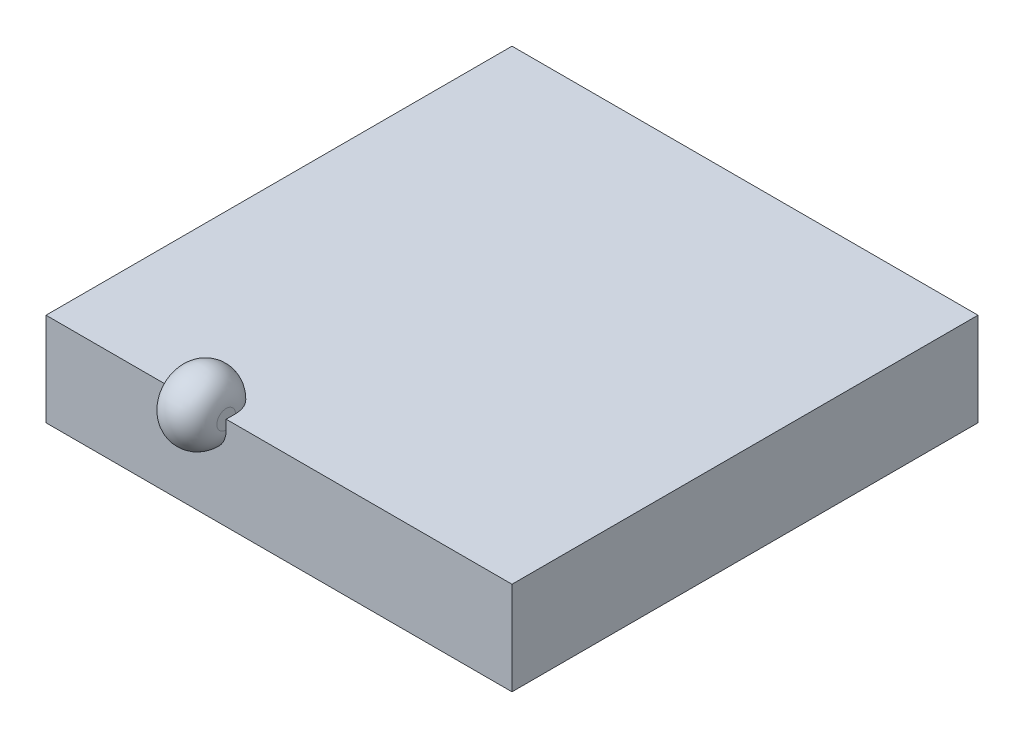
ISO-10303-21;
HEADER;
FILE_DESCRIPTION(('STEP AP214'),'2;1');
FILE_NAME('part.step','',(''),(''),'','','');
FILE_SCHEMA(('AUTOMOTIVE_DESIGN { 1 0 10303 214 1 1 1 1 }'));
ENDSEC;
DATA;
#1=APPLICATION_CONTEXT('core data for automotive mechanical design processes');
#2=APPLICATION_PROTOCOL_DEFINITION('international standard','automotive_design',2000,#1);
#3=PRODUCT_CONTEXT('',#1,'mechanical');
#4=PRODUCT('Part','Part','',(#3));
#5=PRODUCT_RELATED_PRODUCT_CATEGORY('part','',(#4));
#6=PRODUCT_DEFINITION_FORMATION('','',#4);
#7=PRODUCT_DEFINITION_CONTEXT('part definition',#1,'design');
#8=PRODUCT_DEFINITION('design','',#6,#7);
#9=PRODUCT_DEFINITION_SHAPE('','',#8);
#10=(LENGTH_UNIT() NAMED_UNIT(*) SI_UNIT(.MILLI.,.METRE.));
#11=(NAMED_UNIT(*) PLANE_ANGLE_UNIT() SI_UNIT($,.RADIAN.));
#12=(NAMED_UNIT(*) SI_UNIT($,.STERADIAN.) SOLID_ANGLE_UNIT());
#13=UNCERTAINTY_MEASURE_WITH_UNIT(LENGTH_MEASURE(1.E-05),#10,'distance_accuracy_value','');
#14=(GEOMETRIC_REPRESENTATION_CONTEXT(3) GLOBAL_UNCERTAINTY_ASSIGNED_CONTEXT((#13)) GLOBAL_UNIT_ASSIGNED_CONTEXT((#10,
#11,#12)) REPRESENTATION_CONTEXT('',''));
#15=CARTESIAN_POINT('',(0.,0.,0.));
#16=DIRECTION('',(0.,0.,1.));
#17=DIRECTION('',(1.,0.,0.));
#18=AXIS2_PLACEMENT_3D('',#15,#16,#17);
#19=CARTESIAN_POINT('',(-17.,27.,75.));
#20=DIRECTION('',(1.,0.,0.));
#21=DIRECTION('',(0.,1.,0.));
#22=AXIS2_PLACEMENT_3D('',#19,#20,#21);
#23=PLANE('',#22);
#24=CARTESIAN_POINT('',(-17.,30.,75.));
#25=DIRECTION('',(-1.,0.,0.));
#26=DIRECTION('',(0.,-1.,0.));
#27=AXIS2_PLACEMENT_3D('',#24,#25,#26);
#28=CIRCLE('',#27,3.);
#29=CARTESIAN_POINT('',(-17.,27.,75.));
#30=VERTEX_POINT('',#29);
#31=EDGE_CURVE('E47',#30,#30,#28,.T.);
#32=ORIENTED_EDGE('',*,*,#31,.F.);
#33=EDGE_LOOP('',(#32));
#34=FACE_BOUND('',#33,.T.);
#35=ADVANCED_FACE('F41',(#34),#23,.T.);
#36=CARTESIAN_POINT('',(-33.,30.,75.));
#37=DIRECTION('',(-1.,0.,0.));
#38=DIRECTION('',(0.,-1.,0.));
#39=AXIS2_PLACEMENT_3D('',#36,#37,#38);
#40=PLANE('',#39);
#41=CARTESIAN_POINT('',(-33.,30.,75.));
#42=DIRECTION('',(-1.,0.,0.));
#43=DIRECTION('',(0.,-1.,0.));
#44=AXIS2_PLACEMENT_3D('',#41,#42,#43);
#45=CIRCLE('',#44,3.);
#46=CARTESIAN_POINT('',(-33.,27.,75.));
#47=VERTEX_POINT('',#46);
#48=EDGE_CURVE('E11',#47,#47,#45,.T.);
#49=ORIENTED_EDGE('',*,*,#48,.T.);
#50=EDGE_LOOP('',(#49));
#51=FACE_BOUND('',#50,.T.);
#52=ADVANCED_FACE('F57',(#51),#40,.T.);
#53=CARTESIAN_POINT('',(-25.,30.,75.));
#54=DIRECTION('',(-1.,0.,0.));
#55=DIRECTION('',(0.,-1.,0.));
#56=AXIS2_PLACEMENT_3D('',#53,#54,#55);
#57=DEGENERATE_TOROIDAL_SURFACE('',#56,3.,8.00000000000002,.T.);
#58=ORIENTED_EDGE('',*,*,#31,.T.);
#59=EDGE_LOOP('',(#58));
#60=FACE_BOUND('',#59,.T.);
#61=ORIENTED_EDGE('',*,*,#48,.F.);
#62=EDGE_LOOP('',(#61));
#63=FACE_BOUND('',#62,.T.);
#64=ADVANCED_FACE('F53',(#60,#63),#57,.T.);
#65=CLOSED_SHELL('',(#35,#52,#64));
#66=MANIFOLD_SOLID_BREP('B2',#65);
#67=CARTESIAN_POINT('',(75.,30.,75.));
#68=DIRECTION('',(-1.,0.,0.));
#69=DIRECTION('',(0.,0.,1.));
#70=AXIS2_PLACEMENT_3D('',#67,#68,#69);
#71=PLANE('',#70);
#72=DIRECTION('',(0.,0.,-1.));
#73=VECTOR('',#72,1.);
#74=CARTESIAN_POINT('',(75.,0.,75.));
#75=LINE('',#74,#73);
#76=CARTESIAN_POINT('',(75.,0.,75.));
#77=VERTEX_POINT('',#76);
#78=CARTESIAN_POINT('',(75.,0.,-75.));
#79=VERTEX_POINT('',#78);
#80=EDGE_CURVE('E145',#77,#79,#75,.T.);
#81=ORIENTED_EDGE('',*,*,#80,.T.);
#82=DIRECTION('',(0.,-1.,0.));
#83=VECTOR('',#82,1.);
#84=CARTESIAN_POINT('',(75.,30.,-75.));
#85=LINE('',#84,#83);
#86=CARTESIAN_POINT('',(75.,30.,-75.));
#87=VERTEX_POINT('',#86);
#88=EDGE_CURVE('E39',#87,#79,#85,.T.);
#89=ORIENTED_EDGE('',*,*,#88,.F.);
#90=DIRECTION('',(0.,0.,-1.));
#91=VECTOR('',#90,1.);
#92=CARTESIAN_POINT('',(75.,30.,75.));
#93=LINE('',#92,#91);
#94=CARTESIAN_POINT('',(75.,30.,75.));
#95=VERTEX_POINT('',#94);
#96=EDGE_CURVE('E133',#95,#87,#93,.T.);
#97=ORIENTED_EDGE('',*,*,#96,.F.);
#98=DIRECTION('',(0.,-1.,0.));
#99=VECTOR('',#98,1.);
#100=CARTESIAN_POINT('',(75.,30.,75.));
#101=LINE('',#100,#99);
#102=EDGE_CURVE('E141',#95,#77,#101,.T.);
#103=ORIENTED_EDGE('',*,*,#102,.T.);
#104=EDGE_LOOP('',(#81,#89,#97,#103));
#105=FACE_BOUND('',#104,.T.);
#106=ADVANCED_FACE('F82',(#105),#71,.F.);
#107=CARTESIAN_POINT('',(-75.,30.,-75.));
#108=DIRECTION('',(0.,0.,1.));
#109=DIRECTION('',(1.,0.,0.));
#110=AXIS2_PLACEMENT_3D('',#107,#108,#109);
#111=PLANE('',#110);
#112=DIRECTION('',(-1.,0.,0.));
#113=VECTOR('',#112,1.);
#114=CARTESIAN_POINT('',(-75.,0.,-75.));
#115=LINE('',#114,#113);
#116=CARTESIAN_POINT('',(-75.,0.,-75.));
#117=VERTEX_POINT('',#116);
#118=EDGE_CURVE('E137',#79,#117,#115,.T.);
#119=ORIENTED_EDGE('',*,*,#118,.T.);
#120=DIRECTION('',(0.,-1.,0.));
#121=VECTOR('',#120,1.);
#122=CARTESIAN_POINT('',(-75.,30.,-75.));
#123=LINE('',#122,#121);
#124=CARTESIAN_POINT('',(-75.,30.,-75.));
#125=VERTEX_POINT('',#124);
#126=EDGE_CURVE('E90',#125,#117,#123,.T.);
#127=ORIENTED_EDGE('',*,*,#126,.F.);
#128=DIRECTION('',(-1.,0.,0.));
#129=VECTOR('',#128,1.);
#130=CARTESIAN_POINT('',(-75.,30.,-75.));
#131=LINE('',#130,#129);
#132=EDGE_CURVE('E128',#87,#125,#131,.T.);
#133=ORIENTED_EDGE('',*,*,#132,.F.);
#134=ORIENTED_EDGE('',*,*,#88,.T.);
#135=EDGE_LOOP('',(#119,#127,#133,#134));
#136=FACE_BOUND('',#135,.T.);
#137=ADVANCED_FACE('F136',(#136),#111,.F.);
#138=CARTESIAN_POINT('',(-75.,30.,75.));
#139=DIRECTION('',(1.,0.,0.));
#140=DIRECTION('',(0.,0.,-1.));
#141=AXIS2_PLACEMENT_3D('',#138,#139,#140);
#142=PLANE('',#141);
#143=DIRECTION('',(0.,0.,1.));
#144=VECTOR('',#143,1.);
#145=CARTESIAN_POINT('',(-75.,0.,75.));
#146=LINE('',#145,#144);
#147=CARTESIAN_POINT('',(-75.,0.,75.));
#148=VERTEX_POINT('',#147);
#149=EDGE_CURVE('E115',#117,#148,#146,.T.);
#150=ORIENTED_EDGE('',*,*,#149,.T.);
#151=DIRECTION('',(0.,-1.,0.));
#152=VECTOR('',#151,1.);
#153=CARTESIAN_POINT('',(-75.,30.,75.));
#154=LINE('',#153,#152);
#155=CARTESIAN_POINT('',(-75.,30.,75.));
#156=VERTEX_POINT('',#155);
#157=EDGE_CURVE('E138',#156,#148,#154,.T.);
#158=ORIENTED_EDGE('',*,*,#157,.F.);
#159=DIRECTION('',(0.,0.,1.));
#160=VECTOR('',#159,1.);
#161=CARTESIAN_POINT('',(-75.,30.,75.));
#162=LINE('',#161,#160);
#163=EDGE_CURVE('E131',#125,#156,#162,.T.);
#164=ORIENTED_EDGE('',*,*,#163,.F.);
#165=ORIENTED_EDGE('',*,*,#126,.T.);
#166=EDGE_LOOP('',(#150,#158,#164,#165));
#167=FACE_BOUND('',#166,.T.);
#168=ADVANCED_FACE('F139',(#167),#142,.F.);
#169=CARTESIAN_POINT('',(-75.,30.,75.));
#170=DIRECTION('',(0.,0.,-1.));
#171=DIRECTION('',(-1.,0.,0.));
#172=AXIS2_PLACEMENT_3D('',#169,#170,#171);
#173=PLANE('',#172);
#174=DIRECTION('',(1.,0.,0.));
#175=VECTOR('',#174,1.);
#176=CARTESIAN_POINT('',(-75.,0.,75.));
#177=LINE('',#176,#175);
#178=EDGE_CURVE('E121',#148,#77,#177,.T.);
#179=ORIENTED_EDGE('',*,*,#178,.T.);
#180=ORIENTED_EDGE('',*,*,#102,.F.);
#181=DIRECTION('',(1.,0.,0.));
#182=VECTOR('',#181,1.);
#183=CARTESIAN_POINT('',(-75.,30.,75.));
#184=LINE('',#183,#182);
#185=EDGE_CURVE('E98',#156,#95,#184,.T.);
#186=ORIENTED_EDGE('',*,*,#185,.F.);
#187=ORIENTED_EDGE('',*,*,#157,.T.);
#188=EDGE_LOOP('',(#179,#180,#186,#187));
#189=FACE_BOUND('',#188,.T.);
#190=ADVANCED_FACE('F152',(#189),#173,.F.);
#191=CARTESIAN_POINT('',(0.,30.,0.));
#192=DIRECTION('',(0.,-1.,0.));
#193=DIRECTION('',(0.,0.,-1.));
#194=AXIS2_PLACEMENT_3D('',#191,#192,#193);
#195=PLANE('',#194);
#196=ORIENTED_EDGE('',*,*,#96,.T.);
#197=ORIENTED_EDGE('',*,*,#132,.T.);
#198=ORIENTED_EDGE('',*,*,#163,.T.);
#199=ORIENTED_EDGE('',*,*,#185,.T.);
#200=EDGE_LOOP('',(#196,#197,#198,#199));
#201=FACE_BOUND('',#200,.T.);
#202=ADVANCED_FACE('F129',(#201),#195,.F.);
#203=CARTESIAN_POINT('',(0.,0.,0.));
#204=DIRECTION('',(0.,-1.,0.));
#205=DIRECTION('',(0.,0.,-1.));
#206=AXIS2_PLACEMENT_3D('',#203,#204,#205);
#207=PLANE('',#206);
#208=ORIENTED_EDGE('',*,*,#80,.F.);
#209=ORIENTED_EDGE('',*,*,#178,.F.);
#210=ORIENTED_EDGE('',*,*,#149,.F.);
#211=ORIENTED_EDGE('',*,*,#118,.F.);
#212=EDGE_LOOP('',(#208,#209,#210,#211));
#213=FACE_BOUND('',#212,.T.);
#214=ADVANCED_FACE('F155',(#213),#207,.T.);
#215=CLOSED_SHELL('',(#106,#137,#168,#190,#202,#214));
#216=MANIFOLD_SOLID_BREP('B6',#215);
#217=ADVANCED_BREP_SHAPE_REPRESENTATION('',(#18,#66,#216),#14);
#218=SHAPE_DEFINITION_REPRESENTATION(#9,#217);
ENDSEC;
END-ISO-10303-21;
